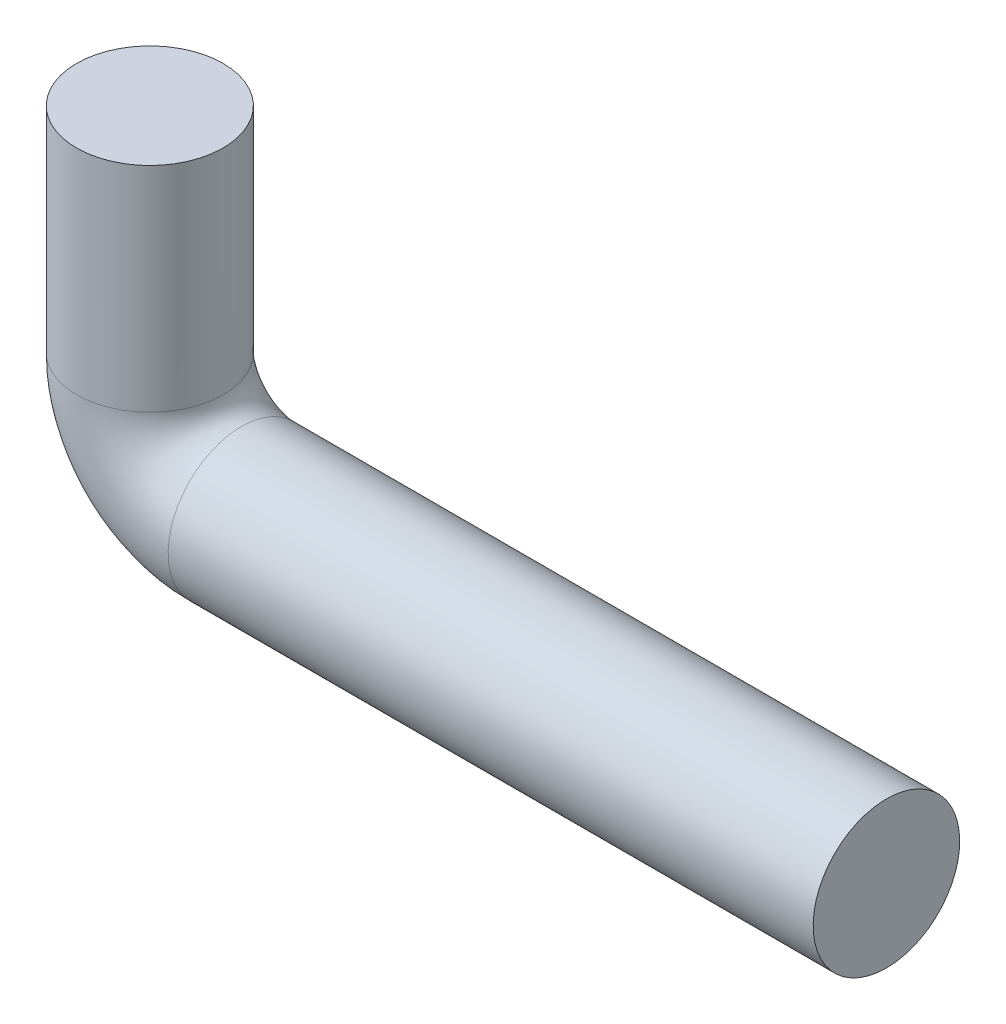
ISO-10303-21;
HEADER;
FILE_DESCRIPTION(('STEP AP214'),'2;1');
FILE_NAME('part.step','',(''),(''),'','','');
FILE_SCHEMA(('AUTOMOTIVE_DESIGN { 1 0 10303 214 1 1 1 1 }'));
ENDSEC;
DATA;
#1=APPLICATION_CONTEXT('core data for automotive mechanical design processes');
#2=APPLICATION_PROTOCOL_DEFINITION('international standard','automotive_design',2000,#1);
#3=PRODUCT_CONTEXT('',#1,'mechanical');
#4=PRODUCT('Part','Part','',(#3));
#5=PRODUCT_RELATED_PRODUCT_CATEGORY('part','',(#4));
#6=PRODUCT_DEFINITION_FORMATION('','',#4);
#7=PRODUCT_DEFINITION_CONTEXT('part definition',#1,'design');
#8=PRODUCT_DEFINITION('design','',#6,#7);
#9=PRODUCT_DEFINITION_SHAPE('','',#8);
#10=(LENGTH_UNIT() NAMED_UNIT(*) SI_UNIT(.MILLI.,.METRE.));
#11=(NAMED_UNIT(*) PLANE_ANGLE_UNIT() SI_UNIT($,.RADIAN.));
#12=(NAMED_UNIT(*) SI_UNIT($,.STERADIAN.) SOLID_ANGLE_UNIT());
#13=UNCERTAINTY_MEASURE_WITH_UNIT(LENGTH_MEASURE(1.E-05),#10,'distance_accuracy_value','');
#14=(GEOMETRIC_REPRESENTATION_CONTEXT(3) GLOBAL_UNCERTAINTY_ASSIGNED_CONTEXT((#13)) GLOBAL_UNIT_ASSIGNED_CONTEXT((#10,
#11,#12)) REPRESENTATION_CONTEXT('',''));
#15=CARTESIAN_POINT('',(0.,0.,0.));
#16=DIRECTION('',(0.,0.,1.));
#17=DIRECTION('',(1.,0.,0.));
#18=AXIS2_PLACEMENT_3D('',#15,#16,#17);
#19=CARTESIAN_POINT('',(120.65,0.,0.));
#20=DIRECTION('',(1.,0.,0.));
#21=DIRECTION('',(0.,0.,-1.));
#22=AXIS2_PLACEMENT_3D('',#19,#20,#21);
#23=PLANE('',#22);
#24=CARTESIAN_POINT('',(120.65,0.,0.));
#25=DIRECTION('',(1.,0.,0.));
#26=DIRECTION('',(0.,0.,-1.));
#27=AXIS2_PLACEMENT_3D('',#24,#25,#26);
#28=CIRCLE('',#27,12.);
#29=CARTESIAN_POINT('',(120.65,0.,-12.));
#30=VERTEX_POINT('',#29);
#31=EDGE_CURVE('E65',#30,#30,#28,.T.);
#32=ORIENTED_EDGE('',*,*,#31,.T.);
#33=EDGE_LOOP('',(#32));
#34=FACE_BOUND('',#33,.T.);
#35=ADVANCED_FACE('F51',(#34),#23,.T.);
#36=CARTESIAN_POINT('',(0.,50.,0.));
#37=DIRECTION('',(0.,-1.,0.));
#38=DIRECTION('',(0.,0.,-1.));
#39=AXIS2_PLACEMENT_3D('',#36,#37,#38);
#40=PLANE('',#39);
#41=CARTESIAN_POINT('',(0.,50.,0.));
#42=DIRECTION('',(0.,-1.,0.));
#43=DIRECTION('',(0.,0.,-1.));
#44=AXIS2_PLACEMENT_3D('',#41,#42,#43);
#45=CIRCLE('',#44,12.);
#46=CARTESIAN_POINT('',(0.,50.,-12.));
#47=VERTEX_POINT('',#46);
#48=EDGE_CURVE('E11',#47,#47,#45,.T.);
#49=ORIENTED_EDGE('',*,*,#48,.F.);
#50=EDGE_LOOP('',(#49));
#51=FACE_BOUND('',#50,.T.);
#52=ADVANCED_FACE('F75',(#51),#40,.F.);
#53=CARTESIAN_POINT('',(120.65,0.,0.));
#54=DIRECTION('',(-1.,0.,0.));
#55=DIRECTION('',(0.,0.,1.));
#56=AXIS2_PLACEMENT_3D('',#53,#54,#55);
#57=CYLINDRICAL_SURFACE('',#56,12.);
#58=CARTESIAN_POINT('',(15.0000000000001,0.,0.));
#59=DIRECTION('',(1.,0.,0.));
#60=DIRECTION('',(0.,0.,-1.));
#61=AXIS2_PLACEMENT_3D('',#58,#59,#60);
#62=CIRCLE('',#61,12.);
#63=CARTESIAN_POINT('',(15.0000000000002,-12.,0.));
#64=VERTEX_POINT('',#63);
#65=EDGE_CURVE('E61',#64,#64,#62,.T.);
#66=ORIENTED_EDGE('',*,*,#65,.T.);
#67=EDGE_LOOP('',(#66));
#68=FACE_BOUND('',#67,.T.);
#69=ORIENTED_EDGE('',*,*,#31,.F.);
#70=EDGE_LOOP('',(#69));
#71=FACE_BOUND('',#70,.T.);
#72=ADVANCED_FACE('F72',(#68,#71),#57,.T.);
#73=CARTESIAN_POINT('',(15.,15.,0.));
#74=DIRECTION('',(0.,0.,-1.));
#75=DIRECTION('',(-1.,0.,0.));
#76=AXIS2_PLACEMENT_3D('',#73,#74,#75);
#77=TOROIDAL_SURFACE('',#76,15.,12.);
#78=CARTESIAN_POINT('',(0.,15.,0.));
#79=DIRECTION('',(0.,-1.,0.));
#80=DIRECTION('',(0.,0.,-1.));
#81=AXIS2_PLACEMENT_3D('',#78,#79,#80);
#82=CIRCLE('',#81,12.);
#83=CARTESIAN_POINT('',(-12.,15.,0.));
#84=VERTEX_POINT('',#83);
#85=EDGE_CURVE('E57',#84,#84,#82,.T.);
#86=CARTESIAN_POINT('',(15.,15.,0.));
#87=DIRECTION('',(0.,0.,-1.));
#88=DIRECTION('',(-1.,0.,0.));
#89=AXIS2_PLACEMENT_3D('',#86,#87,#88);
#90=CIRCLE('',#89,27.);
#91=EDGE_CURVE('',#64,#84,#90,.T.);
#92=ORIENTED_EDGE('',*,*,#65,.F.);
#93=ORIENTED_EDGE('',*,*,#85,.T.);
#94=ORIENTED_EDGE('',*,*,#91,.T.);
#95=ORIENTED_EDGE('',*,*,#91,.F.);
#96=EDGE_LOOP('',(#92,#94,#93,#95));
#97=FACE_BOUND('',#96,.T.);
#98=ADVANCED_FACE('F74',(#97),#77,.T.);
#99=CARTESIAN_POINT('',(0.,15.,0.));
#100=DIRECTION('',(0.,1.,0.));
#101=DIRECTION('',(0.,0.,1.));
#102=AXIS2_PLACEMENT_3D('',#99,#100,#101);
#103=CYLINDRICAL_SURFACE('',#102,12.);
#104=ORIENTED_EDGE('',*,*,#48,.T.);
#105=EDGE_LOOP('',(#104));
#106=FACE_BOUND('',#105,.T.);
#107=ORIENTED_EDGE('',*,*,#85,.F.);
#108=EDGE_LOOP('',(#107));
#109=FACE_BOUND('',#108,.T.);
#110=ADVANCED_FACE('F82',(#106,#109),#103,.T.);
#111=CLOSED_SHELL('',(#35,#52,#72,#98,#110));
#112=MANIFOLD_SOLID_BREP('B2',#111);
#113=ADVANCED_BREP_SHAPE_REPRESENTATION('',(#18,#112),#14);
#114=SHAPE_DEFINITION_REPRESENTATION(#9,#113);
ENDSEC;
END-ISO-10303-21;
